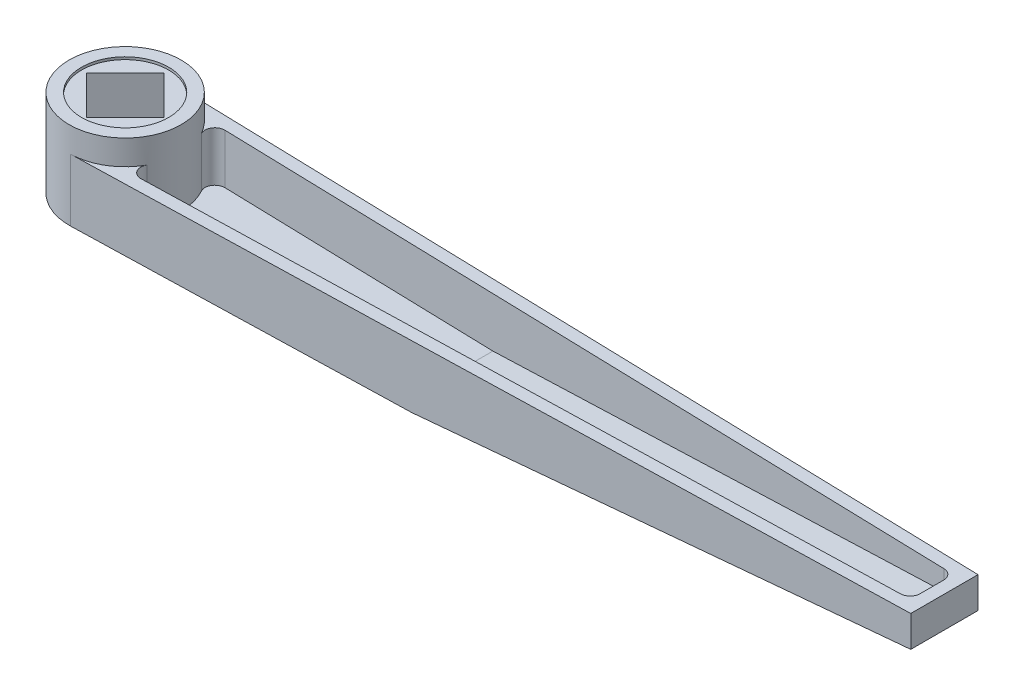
ISO-10303-21;
HEADER;
FILE_DESCRIPTION(('STEP AP214'),'2;1');
FILE_NAME('part.step','',(''),(''),'','','');
FILE_SCHEMA(('AUTOMOTIVE_DESIGN { 1 0 10303 214 1 1 1 1 }'));
ENDSEC;
DATA;
#1=APPLICATION_CONTEXT('core data for automotive mechanical design processes');
#2=APPLICATION_PROTOCOL_DEFINITION('international standard','automotive_design',2000,#1);
#3=PRODUCT_CONTEXT('',#1,'mechanical');
#4=PRODUCT('Part','Part','',(#3));
#5=PRODUCT_RELATED_PRODUCT_CATEGORY('part','',(#4));
#6=PRODUCT_DEFINITION_FORMATION('','',#4);
#7=PRODUCT_DEFINITION_CONTEXT('part definition',#1,'design');
#8=PRODUCT_DEFINITION('design','',#6,#7);
#9=PRODUCT_DEFINITION_SHAPE('','',#8);
#10=(LENGTH_UNIT() NAMED_UNIT(*) SI_UNIT(.MILLI.,.METRE.));
#11=(NAMED_UNIT(*) PLANE_ANGLE_UNIT() SI_UNIT($,.RADIAN.));
#12=(NAMED_UNIT(*) SI_UNIT($,.STERADIAN.) SOLID_ANGLE_UNIT());
#13=UNCERTAINTY_MEASURE_WITH_UNIT(LENGTH_MEASURE(1.E-05),#10,'distance_accuracy_value','');
#14=(GEOMETRIC_REPRESENTATION_CONTEXT(3) GLOBAL_UNCERTAINTY_ASSIGNED_CONTEXT((#13)) GLOBAL_UNIT_ASSIGNED_CONTEXT((#10,
#11,#12)) REPRESENTATION_CONTEXT('',''));
#15=CARTESIAN_POINT('',(0.,0.,0.));
#16=DIRECTION('',(0.,0.,1.));
#17=DIRECTION('',(1.,0.,0.));
#18=AXIS2_PLACEMENT_3D('',#15,#16,#17);
#19=CARTESIAN_POINT('',(0.,34.,0.));
#20=DIRECTION('',(0.,1.,0.));
#21=DIRECTION('',(0.,0.,1.));
#22=AXIS2_PLACEMENT_3D('',#19,#20,#21);
#23=PLANE('',#22);
#24=CARTESIAN_POINT('',(0.,34.,0.));
#25=DIRECTION('',(0.,1.,0.));
#26=DIRECTION('',(0.,0.,1.));
#27=AXIS2_PLACEMENT_3D('',#24,#25,#26);
#28=CIRCLE('',#27,17.5);
#29=CARTESIAN_POINT('',(0.,34.,17.5));
#30=VERTEX_POINT('',#29);
#31=EDGE_CURVE('E233',#30,#30,#28,.T.);
#32=ORIENTED_EDGE('',*,*,#31,.T.);
#33=EDGE_LOOP('',(#32));
#34=FACE_BOUND('',#33,.T.);
#35=DIRECTION('',(-0.707106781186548,0.,0.707106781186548));
#36=VECTOR('',#35,1.);
#37=CARTESIAN_POINT('',(7.77817459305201,34.,7.77817459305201));
#38=LINE('',#37,#36);
#39=CARTESIAN_POINT('',(15.556349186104,34.,0.));
#40=VERTEX_POINT('',#39);
#41=CARTESIAN_POINT('',(0.,34.,15.556349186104));
#42=VERTEX_POINT('',#41);
#43=EDGE_CURVE('E223',#40,#42,#38,.T.);
#44=ORIENTED_EDGE('',*,*,#43,.T.);
#45=DIRECTION('',(-0.707106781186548,0.,-0.707106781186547));
#46=VECTOR('',#45,1.);
#47=CARTESIAN_POINT('',(-7.77817459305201,34.,7.77817459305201));
#48=LINE('',#47,#46);
#49=CARTESIAN_POINT('',(-15.556349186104,34.,0.));
#50=VERTEX_POINT('',#49);
#51=EDGE_CURVE('E190',#42,#50,#48,.T.);
#52=ORIENTED_EDGE('',*,*,#51,.T.);
#53=DIRECTION('',(0.707106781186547,0.,-0.707106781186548));
#54=VECTOR('',#53,1.);
#55=CARTESIAN_POINT('',(-7.77817459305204,34.,-7.77817459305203));
#56=LINE('',#55,#54);
#57=CARTESIAN_POINT('',(0.,34.,-15.5563491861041));
#58=VERTEX_POINT('',#57);
#59=EDGE_CURVE('E193',#50,#58,#56,.T.);
#60=ORIENTED_EDGE('',*,*,#59,.T.);
#61=DIRECTION('',(0.707106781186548,0.,0.707106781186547));
#62=VECTOR('',#61,1.);
#63=CARTESIAN_POINT('',(7.77817459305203,34.,-7.77817459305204));
#64=LINE('',#63,#62);
#65=EDGE_CURVE('E220',#58,#40,#64,.T.);
#66=ORIENTED_EDGE('',*,*,#65,.T.);
#67=EDGE_LOOP('',(#44,#52,#60,#66));
#68=FACE_BOUND('',#67,.T.);
#69=ADVANCED_FACE('F58',(#34,#68),#23,.T.);
#70=CARTESIAN_POINT('',(0.,1.,0.));
#71=DIRECTION('',(0.,-1.,0.));
#72=DIRECTION('',(0.,0.,-1.));
#73=AXIS2_PLACEMENT_3D('',#70,#71,#72);
#74=PLANE('',#73);
#75=CARTESIAN_POINT('',(0.,1.,0.));
#76=DIRECTION('',(0.,-1.,0.));
#77=DIRECTION('',(0.,0.,-1.));
#78=AXIS2_PLACEMENT_3D('',#75,#76,#77);
#79=CIRCLE('',#78,17.5);
#80=CARTESIAN_POINT('',(0.,1.,-17.5));
#81=VERTEX_POINT('',#80);
#82=EDGE_CURVE('E227',#81,#81,#79,.T.);
#83=ORIENTED_EDGE('',*,*,#82,.T.);
#84=EDGE_LOOP('',(#83));
#85=FACE_BOUND('',#84,.T.);
#86=DIRECTION('',(-0.707106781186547,0.,0.707106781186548));
#87=VECTOR('',#86,1.);
#88=CARTESIAN_POINT('',(0.,1.,-15.5563491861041));
#89=LINE('',#88,#87);
#90=CARTESIAN_POINT('',(0.,1.,-15.5563491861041));
#91=VERTEX_POINT('',#90);
#92=CARTESIAN_POINT('',(-15.556349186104,1.,0.));
#93=VERTEX_POINT('',#92);
#94=EDGE_CURVE('E208',#91,#93,#89,.T.);
#95=ORIENTED_EDGE('',*,*,#94,.T.);
#96=DIRECTION('',(0.707106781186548,0.,0.707106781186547));
#97=VECTOR('',#96,1.);
#98=CARTESIAN_POINT('',(-15.556349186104,1.,0.));
#99=LINE('',#98,#97);
#100=CARTESIAN_POINT('',(0.,1.,15.556349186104));
#101=VERTEX_POINT('',#100);
#102=EDGE_CURVE('E187',#93,#101,#99,.T.);
#103=ORIENTED_EDGE('',*,*,#102,.T.);
#104=DIRECTION('',(0.707106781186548,0.,-0.707106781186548));
#105=VECTOR('',#104,1.);
#106=CARTESIAN_POINT('',(15.556349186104,1.,0.));
#107=LINE('',#106,#105);
#108=CARTESIAN_POINT('',(15.556349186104,1.,0.));
#109=VERTEX_POINT('',#108);
#110=EDGE_CURVE('E197',#101,#109,#107,.T.);
#111=ORIENTED_EDGE('',*,*,#110,.T.);
#112=DIRECTION('',(-0.707106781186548,0.,-0.707106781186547));
#113=VECTOR('',#112,1.);
#114=CARTESIAN_POINT('',(0.,1.,-15.5563491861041));
#115=LINE('',#114,#113);
#116=EDGE_CURVE('E203',#109,#91,#115,.T.);
#117=ORIENTED_EDGE('',*,*,#116,.T.);
#118=EDGE_LOOP('',(#95,#103,#111,#117));
#119=FACE_BOUND('',#118,.T.);
#120=ADVANCED_FACE('F206',(#85,#119),#74,.T.);
#121=CARTESIAN_POINT('',(-122.525664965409,25.,0.));
#122=DIRECTION('',(0.,1.,0.));
#123=DIRECTION('',(0.,0.,1.));
#124=AXIS2_PLACEMENT_3D('',#121,#122,#123);
#125=PLANE('',#124);
#126=DIRECTION('',(0.999625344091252,0.,0.027370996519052));
#127=VECTOR('',#126,1.);
#128=CARTESIAN_POINT('',(-121.818024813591,25.,-25.8439633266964));
#129=LINE('',#128,#127);
#130=CARTESIAN_POINT('',(0.615847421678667,25.,-22.4915702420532));
#131=VERTEX_POINT('',#130);
#132=CARTESIAN_POINT('',(329.,25.,-13.5));
#133=VERTEX_POINT('',#132);
#134=EDGE_CURVE('E284',#131,#133,#129,.T.);
#135=ORIENTED_EDGE('',*,*,#134,.F.);
#136=CARTESIAN_POINT('',(0.,25.,0.));
#137=DIRECTION('',(0.,1.,0.));
#138=DIRECTION('',(0.,0.,1.));
#139=AXIS2_PLACEMENT_3D('',#136,#137,#138);
#140=CIRCLE('',#139,22.5);
#141=CARTESIAN_POINT('',(19.6679491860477,25.,-10.9280270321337));
#142=VERTEX_POINT('',#141);
#143=EDGE_CURVE('E247',#131,#142,#140,.F.);
#144=ORIENTED_EDGE('',*,*,#143,.T.);
#145=CARTESIAN_POINT('',(23.1644734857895,25.,-12.870787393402));
#146=DIRECTION('',(0.,1.,0.));
#147=DIRECTION('',(0.,0.,1.));
#148=AXIS2_PLACEMENT_3D('',#145,#146,#147);
#149=CIRCLE('',#148,4.);
#150=CARTESIAN_POINT('',(23.2739574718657,25.,-16.869288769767));
#151=VERTEX_POINT('',#150);
#152=EDGE_CURVE('E334',#142,#151,#149,.F.);
#153=ORIENTED_EDGE('',*,*,#152,.T.);
#154=DIRECTION('',(0.999625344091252,0.,0.027370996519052));
#155=VECTOR('',#154,1.);
#156=CARTESIAN_POINT('',(-121.954879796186,25.,-20.8458366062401));
#157=LINE('',#156,#155);
#158=CARTESIAN_POINT('',(320.109483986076,25.,-8.74155950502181));
#159=VERTEX_POINT('',#158);
#160=EDGE_CURVE('E270',#151,#159,#157,.T.);
#161=ORIENTED_EDGE('',*,*,#160,.T.);
#162=CARTESIAN_POINT('',(320.,25.,-4.7430581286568));
#163=DIRECTION('',(0.,1.,0.));
#164=DIRECTION('',(0.,0.,1.));
#165=AXIS2_PLACEMENT_3D('',#162,#163,#164);
#166=CIRCLE('',#165,4.);
#167=CARTESIAN_POINT('',(324.,25.,-4.7430581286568));
#168=VERTEX_POINT('',#167);
#169=EDGE_CURVE('E12',#159,#168,#166,.F.);
#170=ORIENTED_EDGE('',*,*,#169,.T.);
#171=DIRECTION('',(0.,0.,1.));
#172=VECTOR('',#171,1.);
#173=CARTESIAN_POINT('',(324.,25.,0.));
#174=LINE('',#173,#172);
#175=CARTESIAN_POINT('',(324.,25.,4.7430581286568));
#176=VERTEX_POINT('',#175);
#177=EDGE_CURVE('E259',#168,#176,#174,.T.);
#178=ORIENTED_EDGE('',*,*,#177,.T.);
#179=CARTESIAN_POINT('',(320.,25.,4.7430581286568));
#180=DIRECTION('',(0.,1.,0.));
#181=DIRECTION('',(0.,0.,1.));
#182=AXIS2_PLACEMENT_3D('',#179,#180,#181);
#183=CIRCLE('',#182,4.);
#184=CARTESIAN_POINT('',(320.109483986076,25.,8.74155950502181));
#185=VERTEX_POINT('',#184);
#186=EDGE_CURVE('E66',#176,#185,#183,.F.);
#187=ORIENTED_EDGE('',*,*,#186,.T.);
#188=DIRECTION('',(0.999625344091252,0.,-0.027370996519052));
#189=VECTOR('',#188,1.);
#190=CARTESIAN_POINT('',(-121.954879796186,25.,20.8458366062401));
#191=LINE('',#190,#189);
#192=CARTESIAN_POINT('',(23.2739574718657,25.,16.869288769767));
#193=VERTEX_POINT('',#192);
#194=EDGE_CURVE('E267',#193,#185,#191,.T.);
#195=ORIENTED_EDGE('',*,*,#194,.F.);
#196=CARTESIAN_POINT('',(23.1644734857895,25.,12.870787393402));
#197=DIRECTION('',(0.,1.,0.));
#198=DIRECTION('',(0.,0.,1.));
#199=AXIS2_PLACEMENT_3D('',#196,#197,#198);
#200=CIRCLE('',#199,4.);
#201=CARTESIAN_POINT('',(19.6679491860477,25.,10.9280270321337));
#202=VERTEX_POINT('',#201);
#203=EDGE_CURVE('E336',#193,#202,#200,.F.);
#204=ORIENTED_EDGE('',*,*,#203,.T.);
#205=CARTESIAN_POINT('',(0.615847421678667,25.,22.4915702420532));
#206=VERTEX_POINT('',#205);
#207=EDGE_CURVE('E249',#202,#206,#140,.F.);
#208=ORIENTED_EDGE('',*,*,#207,.T.);
#209=DIRECTION('',(0.999625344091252,0.,-0.027370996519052));
#210=VECTOR('',#209,1.);
#211=CARTESIAN_POINT('',(-121.818024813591,25.,25.8439633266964));
#212=LINE('',#211,#210);
#213=CARTESIAN_POINT('',(329.,25.,13.5));
#214=VERTEX_POINT('',#213);
#215=EDGE_CURVE('E288',#206,#214,#212,.T.);
#216=ORIENTED_EDGE('',*,*,#215,.T.);
#217=DIRECTION('',(0.,0.,1.));
#218=VECTOR('',#217,1.);
#219=CARTESIAN_POINT('',(329.,25.,0.));
#220=LINE('',#219,#218);
#221=EDGE_CURVE('E281',#133,#214,#220,.T.);
#222=ORIENTED_EDGE('',*,*,#221,.F.);
#223=EDGE_LOOP('',(#135,#144,#153,#161,#170,#178,#187,#195,#204,#208,#216,#222));
#224=FACE_BOUND('',#223,.T.);
#225=ADVANCED_FACE('F341',(#224),#125,.T.);
#226=CARTESIAN_POINT('',(-122.525664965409,5.,0.));
#227=DIRECTION('',(0.,1.,0.));
#228=DIRECTION('',(0.,0.,1.));
#229=AXIS2_PLACEMENT_3D('',#226,#227,#228);
#230=PLANE('',#229);
#231=DIRECTION('',(0.999625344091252,0.,0.027370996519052));
#232=VECTOR('',#231,1.);
#233=CARTESIAN_POINT('',(-121.954879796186,5.,-20.8458366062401));
#234=LINE('',#233,#232);
#235=CARTESIAN_POINT('',(23.2739574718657,5.,-16.869288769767));
#236=VERTEX_POINT('',#235);
#237=CARTESIAN_POINT('',(133.839907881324,5.,-13.841854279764));
#238=VERTEX_POINT('',#237);
#239=EDGE_CURVE('E250',#236,#238,#234,.T.);
#240=ORIENTED_EDGE('',*,*,#239,.F.);
#241=CARTESIAN_POINT('',(23.1644734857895,5.,-12.870787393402));
#242=DIRECTION('',(0.,1.,0.));
#243=DIRECTION('',(0.,0.,1.));
#244=AXIS2_PLACEMENT_3D('',#241,#242,#243);
#245=CIRCLE('',#244,4.);
#246=CARTESIAN_POINT('',(19.6679491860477,5.,-10.9280270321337));
#247=VERTEX_POINT('',#246);
#248=EDGE_CURVE('E318',#236,#247,#245,.T.);
#249=ORIENTED_EDGE('',*,*,#248,.T.);
#250=CARTESIAN_POINT('',(0.,5.,0.));
#251=DIRECTION('',(0.,1.,0.));
#252=DIRECTION('',(0.,0.,1.));
#253=AXIS2_PLACEMENT_3D('',#250,#251,#252);
#254=CIRCLE('',#253,22.5);
#255=CARTESIAN_POINT('',(19.6679491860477,5.,10.9280270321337));
#256=VERTEX_POINT('',#255);
#257=EDGE_CURVE('E242',#247,#256,#254,.F.);
#258=ORIENTED_EDGE('',*,*,#257,.T.);
#259=CARTESIAN_POINT('',(23.1644734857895,5.,12.870787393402));
#260=DIRECTION('',(0.,1.,0.));
#261=DIRECTION('',(0.,0.,1.));
#262=AXIS2_PLACEMENT_3D('',#259,#260,#261);
#263=CIRCLE('',#262,4.);
#264=CARTESIAN_POINT('',(23.2739574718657,5.,16.869288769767));
#265=VERTEX_POINT('',#264);
#266=EDGE_CURVE('E316',#256,#265,#263,.T.);
#267=ORIENTED_EDGE('',*,*,#266,.T.);
#268=DIRECTION('',(0.999625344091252,0.,-0.027370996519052));
#269=VECTOR('',#268,1.);
#270=CARTESIAN_POINT('',(-121.954879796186,5.,20.8458366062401));
#271=LINE('',#270,#269);
#272=CARTESIAN_POINT('',(133.839907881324,5.,13.841854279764));
#273=VERTEX_POINT('',#272);
#274=EDGE_CURVE('E252',#265,#273,#271,.T.);
#275=ORIENTED_EDGE('',*,*,#274,.T.);
#276=DIRECTION('',(0.,0.,1.));
#277=VECTOR('',#276,1.);
#278=CARTESIAN_POINT('',(133.839907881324,5.,0.));
#279=LINE('',#278,#277);
#280=EDGE_CURVE('E254',#238,#273,#279,.T.);
#281=ORIENTED_EDGE('',*,*,#280,.F.);
#282=EDGE_LOOP('',(#240,#249,#258,#267,#275,#281));
#283=FACE_BOUND('',#282,.T.);
#284=ADVANCED_FACE('F366',(#283),#230,.T.);
#285=CARTESIAN_POINT('',(-121.954879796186,25.,20.8458366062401));
#286=DIRECTION('',(-0.027370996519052,0.,-0.999625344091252));
#287=DIRECTION('',(-0.999625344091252,0.,0.027370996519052));
#288=AXIS2_PLACEMENT_3D('',#285,#286,#287);
#289=PLANE('',#288);
#290=ORIENTED_EDGE('',*,*,#274,.F.);
#291=DIRECTION('',(0.,-1.,0.));
#292=VECTOR('',#291,1.);
#293=CARTESIAN_POINT('',(23.2739574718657,25.,16.869288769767));
#294=LINE('',#293,#292);
#295=EDGE_CURVE('E323',#265,#193,#294,.F.);
#296=ORIENTED_EDGE('',*,*,#295,.T.);
#297=ORIENTED_EDGE('',*,*,#194,.T.);
#298=DIRECTION('',(0.,-1.,0.));
#299=VECTOR('',#298,1.);
#300=CARTESIAN_POINT('',(320.109483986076,25.,8.74155950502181));
#301=LINE('',#300,#299);
#302=CARTESIAN_POINT('',(320.109483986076,16.9403574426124,8.74155950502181));
#303=VERTEX_POINT('',#302);
#304=EDGE_CURVE('E320',#185,#303,#301,.T.);
#305=ORIENTED_EDGE('',*,*,#304,.T.);
#306=DIRECTION('',(0.997579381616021,0.0639473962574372,-0.027314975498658));
#307=VECTOR('',#306,1.);
#308=CARTESIAN_POINT('',(-119.633013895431,-11.2482642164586,20.7822610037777));
#309=LINE('',#308,#307);
#310=EDGE_CURVE('E253',#273,#303,#309,.T.);
#311=ORIENTED_EDGE('',*,*,#310,.F.);
#312=EDGE_LOOP('',(#290,#296,#297,#305,#311));
#313=FACE_BOUND('',#312,.T.);
#314=ADVANCED_FACE('F346',(#313),#289,.T.);
#315=CARTESIAN_POINT('',(-121.954879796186,25.,-20.8458366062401));
#316=DIRECTION('',(0.027370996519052,0.,-0.999625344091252));
#317=DIRECTION('',(-0.999625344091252,0.,-0.027370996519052));
#318=AXIS2_PLACEMENT_3D('',#315,#316,#317);
#319=PLANE('',#318);
#320=ORIENTED_EDGE('',*,*,#160,.F.);
#321=DIRECTION('',(0.,1.,0.));
#322=VECTOR('',#321,1.);
#323=CARTESIAN_POINT('',(23.2739574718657,5.,-16.869288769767));
#324=LINE('',#323,#322);
#325=EDGE_CURVE('E314',#151,#236,#324,.F.);
#326=ORIENTED_EDGE('',*,*,#325,.T.);
#327=ORIENTED_EDGE('',*,*,#239,.T.);
#328=DIRECTION('',(0.997579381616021,0.0639473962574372,0.027314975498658));
#329=VECTOR('',#328,1.);
#330=CARTESIAN_POINT('',(-119.633013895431,-11.2482642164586,-20.7822610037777));
#331=LINE('',#330,#329);
#332=CARTESIAN_POINT('',(320.109483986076,16.9403574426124,-8.74155950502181));
#333=VERTEX_POINT('',#332);
#334=EDGE_CURVE('E263',#238,#333,#331,.T.);
#335=ORIENTED_EDGE('',*,*,#334,.T.);
#336=DIRECTION('',(0.,-1.,0.));
#337=VECTOR('',#336,1.);
#338=CARTESIAN_POINT('',(320.109483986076,25.,-8.74155950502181));
#339=LINE('',#338,#337);
#340=EDGE_CURVE('E312',#333,#159,#339,.F.);
#341=ORIENTED_EDGE('',*,*,#340,.T.);
#342=EDGE_LOOP('',(#320,#326,#327,#335,#341));
#343=FACE_BOUND('',#342,.T.);
#344=ADVANCED_FACE('F360',(#343),#319,.F.);
#345=CARTESIAN_POINT('',(-122.525664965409,0.,0.));
#346=DIRECTION('',(0.,1.,0.));
#347=DIRECTION('',(0.,0.,1.));
#348=AXIS2_PLACEMENT_3D('',#345,#346,#347);
#349=PLANE('',#348);
#350=CARTESIAN_POINT('',(0.,0.,0.));
#351=DIRECTION('',(0.,-1.,0.));
#352=DIRECTION('',(0.,0.,-1.));
#353=AXIS2_PLACEMENT_3D('',#350,#351,#352);
#354=CIRCLE('',#353,17.5);
#355=CARTESIAN_POINT('',(0.,0.,-17.5));
#356=VERTEX_POINT('',#355);
#357=EDGE_CURVE('E226',#356,#356,#354,.T.);
#358=ORIENTED_EDGE('',*,*,#357,.F.);
#359=EDGE_LOOP('',(#358));
#360=FACE_BOUND('',#359,.T.);
#361=CARTESIAN_POINT('',(0.,0.,0.));
#362=DIRECTION('',(0.,1.,0.));
#363=DIRECTION('',(0.,0.,1.));
#364=AXIS2_PLACEMENT_3D('',#361,#362,#363);
#365=CIRCLE('',#364,22.5);
#366=CARTESIAN_POINT('',(0.615847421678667,0.,-22.4915702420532));
#367=VERTEX_POINT('',#366);
#368=CARTESIAN_POINT('',(0.615847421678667,0.,22.4915702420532));
#369=VERTEX_POINT('',#368);
#370=EDGE_CURVE('E236',#367,#369,#365,.T.);
#371=ORIENTED_EDGE('',*,*,#370,.F.);
#372=DIRECTION('',(0.999625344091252,0.,0.027370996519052));
#373=VECTOR('',#372,1.);
#374=CARTESIAN_POINT('',(-121.818024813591,0.,-25.8439633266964));
#375=LINE('',#374,#373);
#376=CARTESIAN_POINT('',(134.,0.,-18.8393447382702));
#377=VERTEX_POINT('',#376);
#378=EDGE_CURVE('E280',#367,#377,#375,.T.);
#379=ORIENTED_EDGE('',*,*,#378,.T.);
#380=DIRECTION('',(0.,0.,1.));
#381=VECTOR('',#380,1.);
#382=CARTESIAN_POINT('',(134.,0.,-22.4915702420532));
#383=LINE('',#382,#381);
#384=CARTESIAN_POINT('',(134.,0.,18.8393447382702));
#385=VERTEX_POINT('',#384);
#386=EDGE_CURVE('E273',#377,#385,#383,.T.);
#387=ORIENTED_EDGE('',*,*,#386,.T.);
#388=DIRECTION('',(0.999625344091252,0.,-0.027370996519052));
#389=VECTOR('',#388,1.);
#390=CARTESIAN_POINT('',(-121.818024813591,0.,25.8439633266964));
#391=LINE('',#390,#389);
#392=EDGE_CURVE('E285',#369,#385,#391,.T.);
#393=ORIENTED_EDGE('',*,*,#392,.F.);
#394=EDGE_LOOP('',(#371,#379,#387,#393));
#395=FACE_BOUND('',#394,.T.);
#396=ADVANCED_FACE('F384',(#360,#395),#349,.F.);
#397=CARTESIAN_POINT('',(-121.818024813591,25.,25.8439633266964));
#398=DIRECTION('',(-0.027370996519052,0.,-0.999625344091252));
#399=DIRECTION('',(-0.999625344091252,0.,0.027370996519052));
#400=AXIS2_PLACEMENT_3D('',#397,#398,#399);
#401=PLANE('',#400);
#402=ORIENTED_EDGE('',*,*,#392,.T.);
#403=DIRECTION('',(0.997579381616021,0.0639473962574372,-0.027314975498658));
#404=VECTOR('',#403,1.);
#405=CARTESIAN_POINT('',(-119.177100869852,-16.229301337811,25.7716515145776));
#406=LINE('',#405,#404);
#407=CARTESIAN_POINT('',(329.,12.5,13.5));
#408=VERTEX_POINT('',#407);
#409=EDGE_CURVE('E276',#385,#408,#406,.T.);
#410=ORIENTED_EDGE('',*,*,#409,.T.);
#411=DIRECTION('',(0.,-1.,0.));
#412=VECTOR('',#411,1.);
#413=CARTESIAN_POINT('',(329.,25.,13.5));
#414=LINE('',#413,#412);
#415=EDGE_CURVE('E290',#214,#408,#414,.T.);
#416=ORIENTED_EDGE('',*,*,#415,.F.);
#417=ORIENTED_EDGE('',*,*,#215,.F.);
#418=DIRECTION('',(0.,-1.,0.));
#419=VECTOR('',#418,1.);
#420=CARTESIAN_POINT('',(0.615847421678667,25.,22.4915702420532));
#421=LINE('',#420,#419);
#422=EDGE_CURVE('E297',#206,#369,#421,.T.);
#423=ORIENTED_EDGE('',*,*,#422,.T.);
#424=EDGE_LOOP('',(#402,#410,#416,#417,#423));
#425=FACE_BOUND('',#424,.T.);
#426=ADVANCED_FACE('F377',(#425),#401,.F.);
#427=CARTESIAN_POINT('',(329.,25.,0.));
#428=DIRECTION('',(1.,0.,0.));
#429=DIRECTION('',(0.,0.,-1.));
#430=AXIS2_PLACEMENT_3D('',#427,#428,#429);
#431=PLANE('',#430);
#432=DIRECTION('',(0.,0.,1.));
#433=VECTOR('',#432,1.);
#434=CARTESIAN_POINT('',(329.,12.5,-22.4915702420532));
#435=LINE('',#434,#433);
#436=CARTESIAN_POINT('',(329.,12.5,-13.5));
#437=VERTEX_POINT('',#436);
#438=EDGE_CURVE('E266',#437,#408,#435,.T.);
#439=ORIENTED_EDGE('',*,*,#438,.F.);
#440=DIRECTION('',(0.,-1.,0.));
#441=VECTOR('',#440,1.);
#442=CARTESIAN_POINT('',(329.,25.,-13.5));
#443=LINE('',#442,#441);
#444=EDGE_CURVE('E302',#133,#437,#443,.T.);
#445=ORIENTED_EDGE('',*,*,#444,.F.);
#446=ORIENTED_EDGE('',*,*,#221,.T.);
#447=ORIENTED_EDGE('',*,*,#415,.T.);
#448=EDGE_LOOP('',(#439,#445,#446,#447));
#449=FACE_BOUND('',#448,.T.);
#450=ADVANCED_FACE('F388',(#449),#431,.T.);
#451=CARTESIAN_POINT('',(-121.818024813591,25.,-25.8439633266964));
#452=DIRECTION('',(0.027370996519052,0.,-0.999625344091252));
#453=DIRECTION('',(-0.999625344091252,0.,-0.027370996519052));
#454=AXIS2_PLACEMENT_3D('',#451,#452,#453);
#455=PLANE('',#454);
#456=DIRECTION('',(0.997579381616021,0.0639473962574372,0.027314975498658));
#457=VECTOR('',#456,1.);
#458=CARTESIAN_POINT('',(-119.177100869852,-16.229301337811,-25.7716515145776));
#459=LINE('',#458,#457);
#460=EDGE_CURVE('E305',#377,#437,#459,.T.);
#461=ORIENTED_EDGE('',*,*,#460,.F.);
#462=ORIENTED_EDGE('',*,*,#378,.F.);
#463=DIRECTION('',(0.,-1.,0.));
#464=VECTOR('',#463,1.);
#465=CARTESIAN_POINT('',(0.615847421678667,25.,-22.4915702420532));
#466=LINE('',#465,#464);
#467=EDGE_CURVE('E299',#131,#367,#466,.T.);
#468=ORIENTED_EDGE('',*,*,#467,.F.);
#469=ORIENTED_EDGE('',*,*,#134,.T.);
#470=ORIENTED_EDGE('',*,*,#444,.T.);
#471=EDGE_LOOP('',(#461,#462,#468,#469,#470));
#472=FACE_BOUND('',#471,.T.);
#473=ADVANCED_FACE('F391',(#472),#455,.T.);
#474=CARTESIAN_POINT('',(329.,12.5,-22.4915702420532));
#475=DIRECTION('',(-0.063971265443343,0.997951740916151,0.));
#476=DIRECTION('',(-0.997951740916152,-0.063971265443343,0.));
#477=AXIS2_PLACEMENT_3D('',#474,#475,#476);
#478=PLANE('',#477);
#479=ORIENTED_EDGE('',*,*,#386,.F.);
#480=ORIENTED_EDGE('',*,*,#460,.T.);
#481=ORIENTED_EDGE('',*,*,#438,.T.);
#482=ORIENTED_EDGE('',*,*,#409,.F.);
#483=EDGE_LOOP('',(#479,#480,#481,#482));
#484=FACE_BOUND('',#483,.T.);
#485=ADVANCED_FACE('F392',(#484),#478,.F.);
#486=CARTESIAN_POINT('',(324.,25.,0.));
#487=DIRECTION('',(1.,0.,0.));
#488=DIRECTION('',(0.,0.,-1.));
#489=AXIS2_PLACEMENT_3D('',#486,#487,#488);
#490=PLANE('',#489);
#491=DIRECTION('',(0.,0.,1.));
#492=VECTOR('',#491,1.);
#493=CARTESIAN_POINT('',(324.,17.189749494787,0.));
#494=LINE('',#493,#492);
#495=CARTESIAN_POINT('',(324.,17.189749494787,-4.7430581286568));
#496=VERTEX_POINT('',#495);
#497=CARTESIAN_POINT('',(324.,17.189749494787,4.7430581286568));
#498=VERTEX_POINT('',#497);
#499=EDGE_CURVE('E257',#496,#498,#494,.T.);
#500=ORIENTED_EDGE('',*,*,#499,.T.);
#501=DIRECTION('',(0.,-1.,0.));
#502=VECTOR('',#501,1.);
#503=CARTESIAN_POINT('',(324.,25.,4.7430581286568));
#504=LINE('',#503,#502);
#505=EDGE_CURVE('E73',#498,#176,#504,.F.);
#506=ORIENTED_EDGE('',*,*,#505,.T.);
#507=ORIENTED_EDGE('',*,*,#177,.F.);
#508=DIRECTION('',(0.,-1.,0.));
#509=VECTOR('',#508,1.);
#510=CARTESIAN_POINT('',(324.,17.189749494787,-4.7430581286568));
#511=LINE('',#510,#509);
#512=EDGE_CURVE('E330',#168,#496,#511,.T.);
#513=ORIENTED_EDGE('',*,*,#512,.T.);
#514=EDGE_LOOP('',(#500,#506,#507,#513));
#515=FACE_BOUND('',#514,.T.);
#516=ADVANCED_FACE('F353',(#515),#490,.F.);
#517=CARTESIAN_POINT('',(328.680143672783,17.4897587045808,-22.4915702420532));
#518=DIRECTION('',(-0.063971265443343,0.997951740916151,0.));
#519=DIRECTION('',(-0.997951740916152,-0.063971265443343,0.));
#520=AXIS2_PLACEMENT_3D('',#517,#518,#519);
#521=PLANE('',#520);
#522=ORIENTED_EDGE('',*,*,#310,.T.);
#523=CARTESIAN_POINT('',(320.,16.9333392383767,4.7430581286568));
#524=DIRECTION('',(-0.063971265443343,0.997951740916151,0.));
#525=DIRECTION('',(-0.997951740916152,-0.063971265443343,0.));
#526=AXIS2_PLACEMENT_3D('',#523,#524,#525);
#527=ELLIPSE('',#526,4.00820985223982,4.);
#528=EDGE_CURVE('E328',#303,#498,#527,.T.);
#529=ORIENTED_EDGE('',*,*,#528,.T.);
#530=ORIENTED_EDGE('',*,*,#499,.F.);
#531=CARTESIAN_POINT('',(320.,16.9333392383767,-4.7430581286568));
#532=DIRECTION('',(-0.063971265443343,0.997951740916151,0.));
#533=DIRECTION('',(0.997951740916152,0.063971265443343,0.));
#534=AXIS2_PLACEMENT_3D('',#531,#532,#533);
#535=ELLIPSE('',#534,4.00820985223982,4.);
#536=EDGE_CURVE('E326',#496,#333,#535,.T.);
#537=ORIENTED_EDGE('',*,*,#536,.T.);
#538=ORIENTED_EDGE('',*,*,#334,.F.);
#539=ORIENTED_EDGE('',*,*,#280,.T.);
#540=EDGE_LOOP('',(#522,#529,#530,#537,#538,#539));
#541=FACE_BOUND('',#540,.T.);
#542=ADVANCED_FACE('F352',(#541),#521,.T.);
#543=CARTESIAN_POINT('',(0.,35.,0.));
#544=DIRECTION('',(0.,-1.,0.));
#545=DIRECTION('',(0.,0.,-1.));
#546=AXIS2_PLACEMENT_3D('',#543,#544,#545);
#547=CYLINDRICAL_SURFACE('',#546,22.5);
#548=CARTESIAN_POINT('',(0.,35.,0.));
#549=DIRECTION('',(0.,1.,0.));
#550=DIRECTION('',(0.,0.,1.));
#551=AXIS2_PLACEMENT_3D('',#548,#549,#550);
#552=CIRCLE('',#551,22.5);
#553=CARTESIAN_POINT('',(0.,35.,22.5));
#554=VERTEX_POINT('',#553);
#555=EDGE_CURVE('E239',#554,#554,#552,.T.);
#556=ORIENTED_EDGE('',*,*,#555,.F.);
#557=EDGE_LOOP('',(#556));
#558=FACE_BOUND('',#557,.T.);
#559=ORIENTED_EDGE('',*,*,#257,.F.);
#560=DIRECTION('',(0.,-1.,0.));
#561=VECTOR('',#560,1.);
#562=CARTESIAN_POINT('',(19.6679491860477,35.,-10.9280270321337));
#563=LINE('',#562,#561);
#564=EDGE_CURVE('E309',#247,#142,#563,.F.);
#565=ORIENTED_EDGE('',*,*,#564,.T.);
#566=ORIENTED_EDGE('',*,*,#143,.F.);
#567=ORIENTED_EDGE('',*,*,#467,.T.);
#568=ORIENTED_EDGE('',*,*,#370,.T.);
#569=ORIENTED_EDGE('',*,*,#422,.F.);
#570=ORIENTED_EDGE('',*,*,#207,.F.);
#571=DIRECTION('',(0.,-1.,0.));
#572=VECTOR('',#571,1.);
#573=CARTESIAN_POINT('',(19.6679491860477,35.,10.9280270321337));
#574=LINE('',#573,#572);
#575=EDGE_CURVE('E307',#202,#256,#574,.T.);
#576=ORIENTED_EDGE('',*,*,#575,.T.);
#577=EDGE_LOOP('',(#559,#565,#566,#567,#568,#569,#570,#576));
#578=FACE_BOUND('',#577,.T.);
#579=ADVANCED_FACE('F380',(#558,#578),#547,.T.);
#580=CARTESIAN_POINT('',(0.,35.,0.));
#581=DIRECTION('',(0.,1.,0.));
#582=DIRECTION('',(0.,0.,1.));
#583=AXIS2_PLACEMENT_3D('',#580,#581,#582);
#584=PLANE('',#583);
#585=CARTESIAN_POINT('',(0.,35.,0.));
#586=DIRECTION('',(0.,1.,0.));
#587=DIRECTION('',(0.,0.,1.));
#588=AXIS2_PLACEMENT_3D('',#585,#586,#587);
#589=CIRCLE('',#588,17.5);
#590=CARTESIAN_POINT('',(0.,35.,17.5));
#591=VERTEX_POINT('',#590);
#592=EDGE_CURVE('E230',#591,#591,#589,.T.);
#593=ORIENTED_EDGE('',*,*,#592,.F.);
#594=EDGE_LOOP('',(#593));
#595=FACE_BOUND('',#594,.T.);
#596=ORIENTED_EDGE('',*,*,#555,.T.);
#597=EDGE_LOOP('',(#596));
#598=FACE_BOUND('',#597,.T.);
#599=ADVANCED_FACE('F418',(#595,#598),#584,.T.);
#600=CARTESIAN_POINT('',(0.,34.,0.));
#601=DIRECTION('',(0.,1.,0.));
#602=DIRECTION('',(0.,0.,1.));
#603=AXIS2_PLACEMENT_3D('',#600,#601,#602);
#604=CYLINDRICAL_SURFACE('',#603,17.5);
#605=ORIENTED_EDGE('',*,*,#31,.F.);
#606=EDGE_LOOP('',(#605));
#607=FACE_BOUND('',#606,.T.);
#608=ORIENTED_EDGE('',*,*,#592,.T.);
#609=EDGE_LOOP('',(#608));
#610=FACE_BOUND('',#609,.T.);
#611=ADVANCED_FACE('F415',(#607,#610),#604,.F.);
#612=CARTESIAN_POINT('',(0.,1.,0.));
#613=DIRECTION('',(0.,-1.,0.));
#614=DIRECTION('',(0.,0.,-1.));
#615=AXIS2_PLACEMENT_3D('',#612,#613,#614);
#616=CYLINDRICAL_SURFACE('',#615,17.5);
#617=ORIENTED_EDGE('',*,*,#82,.F.);
#618=EDGE_LOOP('',(#617));
#619=FACE_BOUND('',#618,.T.);
#620=ORIENTED_EDGE('',*,*,#357,.T.);
#621=EDGE_LOOP('',(#620));
#622=FACE_BOUND('',#621,.T.);
#623=ADVANCED_FACE('F414',(#619,#622),#616,.F.);
#624=CARTESIAN_POINT('',(-15.556349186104,35.,0.));
#625=DIRECTION('',(0.707106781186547,0.,-0.707106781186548));
#626=DIRECTION('',(-0.707106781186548,0.,-0.707106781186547));
#627=AXIS2_PLACEMENT_3D('',#624,#625,#626);
#628=PLANE('',#627);
#629=DIRECTION('',(0.,-1.,0.));
#630=VECTOR('',#629,1.);
#631=CARTESIAN_POINT('',(0.,35.,15.556349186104));
#632=LINE('',#631,#630);
#633=EDGE_CURVE('E182',#42,#101,#632,.T.);
#634=ORIENTED_EDGE('',*,*,#633,.T.);
#635=ORIENTED_EDGE('',*,*,#102,.F.);
#636=DIRECTION('',(0.,-1.,0.));
#637=VECTOR('',#636,1.);
#638=CARTESIAN_POINT('',(-15.556349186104,35.,0.));
#639=LINE('',#638,#637);
#640=EDGE_CURVE('E213',#50,#93,#639,.T.);
#641=ORIENTED_EDGE('',*,*,#640,.F.);
#642=ORIENTED_EDGE('',*,*,#51,.F.);
#643=EDGE_LOOP('',(#634,#635,#641,#642));
#644=FACE_BOUND('',#643,.T.);
#645=ADVANCED_FACE('F184',(#644),#628,.T.);
#646=CARTESIAN_POINT('',(15.556349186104,35.,0.));
#647=DIRECTION('',(-0.707106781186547,0.,-0.707106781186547));
#648=DIRECTION('',(-0.707106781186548,0.,0.707106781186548));
#649=AXIS2_PLACEMENT_3D('',#646,#647,#648);
#650=PLANE('',#649);
#651=DIRECTION('',(0.,-1.,0.));
#652=VECTOR('',#651,1.);
#653=CARTESIAN_POINT('',(15.556349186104,35.,0.));
#654=LINE('',#653,#652);
#655=EDGE_CURVE('E194',#40,#109,#654,.T.);
#656=ORIENTED_EDGE('',*,*,#655,.T.);
#657=ORIENTED_EDGE('',*,*,#110,.F.);
#658=ORIENTED_EDGE('',*,*,#633,.F.);
#659=ORIENTED_EDGE('',*,*,#43,.F.);
#660=EDGE_LOOP('',(#656,#657,#658,#659));
#661=FACE_BOUND('',#660,.T.);
#662=ADVANCED_FACE('F198',(#661),#650,.T.);
#663=CARTESIAN_POINT('',(0.,35.,-15.5563491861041));
#664=DIRECTION('',(-0.707106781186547,0.,0.707106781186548));
#665=DIRECTION('',(0.707106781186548,0.,0.707106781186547));
#666=AXIS2_PLACEMENT_3D('',#663,#664,#665);
#667=PLANE('',#666);
#668=DIRECTION('',(0.,-1.,0.));
#669=VECTOR('',#668,1.);
#670=CARTESIAN_POINT('',(0.,35.,-15.5563491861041));
#671=LINE('',#670,#669);
#672=EDGE_CURVE('E215',#58,#91,#671,.T.);
#673=ORIENTED_EDGE('',*,*,#672,.T.);
#674=ORIENTED_EDGE('',*,*,#116,.F.);
#675=ORIENTED_EDGE('',*,*,#655,.F.);
#676=ORIENTED_EDGE('',*,*,#65,.F.);
#677=EDGE_LOOP('',(#673,#674,#675,#676));
#678=FACE_BOUND('',#677,.T.);
#679=ADVANCED_FACE('F470',(#678),#667,.T.);
#680=CARTESIAN_POINT('',(0.,35.,-15.5563491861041));
#681=DIRECTION('',(0.707106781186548,0.,0.707106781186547));
#682=DIRECTION('',(0.707106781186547,0.,-0.707106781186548));
#683=AXIS2_PLACEMENT_3D('',#680,#681,#682);
#684=PLANE('',#683);
#685=ORIENTED_EDGE('',*,*,#640,.T.);
#686=ORIENTED_EDGE('',*,*,#94,.F.);
#687=ORIENTED_EDGE('',*,*,#672,.F.);
#688=ORIENTED_EDGE('',*,*,#59,.F.);
#689=EDGE_LOOP('',(#685,#686,#687,#688));
#690=FACE_BOUND('',#689,.T.);
#691=ADVANCED_FACE('F477',(#690),#684,.T.);
#692=CARTESIAN_POINT('',(23.1644734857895,35.,-12.870787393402));
#693=DIRECTION('',(0.,-1.,0.));
#694=DIRECTION('',(0.,0.,-1.));
#695=AXIS2_PLACEMENT_3D('',#692,#693,#694);
#696=CYLINDRICAL_SURFACE('',#695,4.);
#697=ORIENTED_EDGE('',*,*,#248,.F.);
#698=ORIENTED_EDGE('',*,*,#325,.F.);
#699=ORIENTED_EDGE('',*,*,#152,.F.);
#700=ORIENTED_EDGE('',*,*,#564,.F.);
#701=EDGE_LOOP('',(#697,#698,#699,#700));
#702=FACE_BOUND('',#701,.T.);
#703=ADVANCED_FACE('F485',(#702),#696,.F.);
#704=CARTESIAN_POINT('',(23.1644734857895,35.,12.870787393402));
#705=DIRECTION('',(0.,-1.,0.));
#706=DIRECTION('',(0.,0.,-1.));
#707=AXIS2_PLACEMENT_3D('',#704,#705,#706);
#708=CYLINDRICAL_SURFACE('',#707,4.);
#709=ORIENTED_EDGE('',*,*,#266,.F.);
#710=ORIENTED_EDGE('',*,*,#575,.F.);
#711=ORIENTED_EDGE('',*,*,#203,.F.);
#712=ORIENTED_EDGE('',*,*,#295,.F.);
#713=EDGE_LOOP('',(#709,#710,#711,#712));
#714=FACE_BOUND('',#713,.T.);
#715=ADVANCED_FACE('F369',(#714),#708,.F.);
#716=CARTESIAN_POINT('',(320.,25.,4.7430581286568));
#717=DIRECTION('',(0.,-1.,0.));
#718=DIRECTION('',(0.,0.,-1.));
#719=AXIS2_PLACEMENT_3D('',#716,#717,#718);
#720=CYLINDRICAL_SURFACE('',#719,4.);
#721=ORIENTED_EDGE('',*,*,#186,.F.);
#722=ORIENTED_EDGE('',*,*,#505,.F.);
#723=ORIENTED_EDGE('',*,*,#528,.F.);
#724=ORIENTED_EDGE('',*,*,#304,.F.);
#725=EDGE_LOOP('',(#721,#722,#723,#724));
#726=FACE_BOUND('',#725,.T.);
#727=ADVANCED_FACE('F349',(#726),#720,.F.);
#728=CARTESIAN_POINT('',(320.,25.,-4.7430581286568));
#729=DIRECTION('',(0.,1.,0.));
#730=DIRECTION('',(0.,0.,1.));
#731=AXIS2_PLACEMENT_3D('',#728,#729,#730);
#732=CYLINDRICAL_SURFACE('',#731,4.);
#733=ORIENTED_EDGE('',*,*,#169,.F.);
#734=ORIENTED_EDGE('',*,*,#340,.F.);
#735=ORIENTED_EDGE('',*,*,#536,.F.);
#736=ORIENTED_EDGE('',*,*,#512,.F.);
#737=EDGE_LOOP('',(#733,#734,#735,#736));
#738=FACE_BOUND('',#737,.T.);
#739=ADVANCED_FACE('F60',(#738),#732,.F.);
#740=CLOSED_SHELL('',(#69,#120,#225,#284,#314,#344,#396,#426,#450,#473,#485,#516,#542,#579,#599,
#611,#623,#645,#662,#679,#691,#703,#715,#727,#739));
#741=MANIFOLD_SOLID_BREP('B2',#740);
#742=ADVANCED_BREP_SHAPE_REPRESENTATION('',(#18,#741),#14);
#743=SHAPE_DEFINITION_REPRESENTATION(#9,#742);
ENDSEC;
END-ISO-10303-21;
